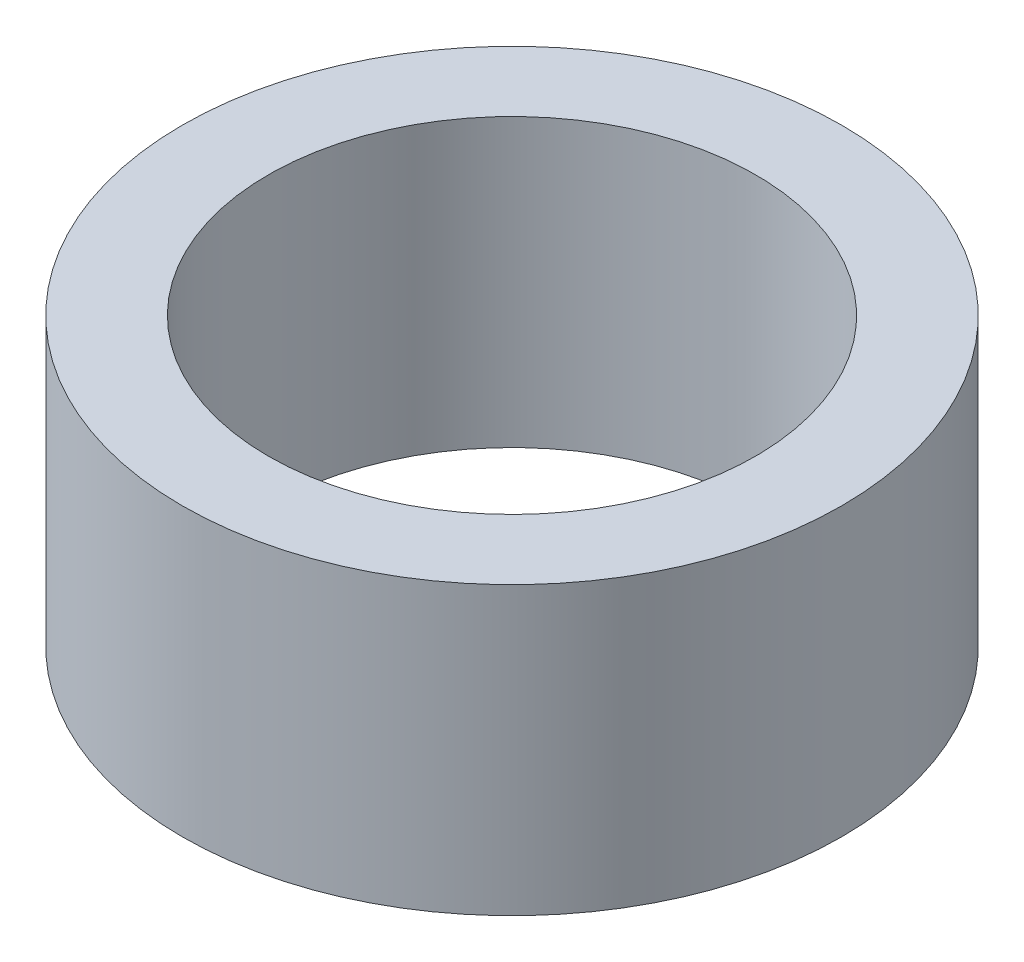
ISO-10303-21;
HEADER;
FILE_DESCRIPTION(('STEP AP214'),'2;1');
FILE_NAME('part.step','',(''),(''),'','','');
FILE_SCHEMA(('AUTOMOTIVE_DESIGN { 1 0 10303 214 1 1 1 1 }'));
ENDSEC;
DATA;
#1=APPLICATION_CONTEXT('core data for automotive mechanical design processes');
#2=APPLICATION_PROTOCOL_DEFINITION('international standard','automotive_design',2000,#1);
#3=PRODUCT_CONTEXT('',#1,'mechanical');
#4=PRODUCT('Part','Part','',(#3));
#5=PRODUCT_RELATED_PRODUCT_CATEGORY('part','',(#4));
#6=PRODUCT_DEFINITION_FORMATION('','',#4);
#7=PRODUCT_DEFINITION_CONTEXT('part definition',#1,'design');
#8=PRODUCT_DEFINITION('design','',#6,#7);
#9=PRODUCT_DEFINITION_SHAPE('','',#8);
#10=(LENGTH_UNIT() NAMED_UNIT(*) SI_UNIT(.MILLI.,.METRE.));
#11=(NAMED_UNIT(*) PLANE_ANGLE_UNIT() SI_UNIT($,.RADIAN.));
#12=(NAMED_UNIT(*) SI_UNIT($,.STERADIAN.) SOLID_ANGLE_UNIT());
#13=UNCERTAINTY_MEASURE_WITH_UNIT(LENGTH_MEASURE(1.E-05),#10,'distance_accuracy_value','');
#14=(GEOMETRIC_REPRESENTATION_CONTEXT(3) GLOBAL_UNCERTAINTY_ASSIGNED_CONTEXT((#13)) GLOBAL_UNIT_ASSIGNED_CONTEXT((#10,
#11,#12)) REPRESENTATION_CONTEXT('',''));
#15=CARTESIAN_POINT('',(0.,0.,0.));
#16=DIRECTION('',(0.,0.,1.));
#17=DIRECTION('',(1.,0.,0.));
#18=AXIS2_PLACEMENT_3D('',#15,#16,#17);
#19=CARTESIAN_POINT('',(0.,5.,0.));
#20=DIRECTION('',(0.,1.,0.));
#21=DIRECTION('',(0.,0.,1.));
#22=AXIS2_PLACEMENT_3D('',#19,#20,#21);
#23=PLANE('',#22);
#24=CARTESIAN_POINT('',(0.,5.,0.));
#25=DIRECTION('',(0.,1.,0.));
#26=DIRECTION('',(0.,0.,1.));
#27=AXIS2_PLACEMENT_3D('',#24,#25,#26);
#28=CIRCLE('',#27,5.75);
#29=CARTESIAN_POINT('',(0.,5.,5.75));
#30=VERTEX_POINT('',#29);
#31=EDGE_CURVE('E10',#30,#30,#28,.T.);
#32=ORIENTED_EDGE('',*,*,#31,.T.);
#33=EDGE_LOOP('',(#32));
#34=FACE_BOUND('',#33,.T.);
#35=CARTESIAN_POINT('',(0.,5.,0.));
#36=DIRECTION('',(0.,1.,0.));
#37=DIRECTION('',(0.,0.,1.));
#38=AXIS2_PLACEMENT_3D('',#35,#36,#37);
#39=CIRCLE('',#38,4.25);
#40=CARTESIAN_POINT('',(0.,5.,4.25));
#41=VERTEX_POINT('',#40);
#42=EDGE_CURVE('E45',#41,#41,#39,.T.);
#43=ORIENTED_EDGE('',*,*,#42,.F.);
#44=EDGE_LOOP('',(#43));
#45=FACE_BOUND('',#44,.T.);
#46=ADVANCED_FACE('F34',(#34,#45),#23,.T.);
#47=CARTESIAN_POINT('',(0.,0.,0.));
#48=DIRECTION('',(0.,1.,0.));
#49=DIRECTION('',(0.,0.,1.));
#50=AXIS2_PLACEMENT_3D('',#47,#48,#49);
#51=PLANE('',#50);
#52=CARTESIAN_POINT('',(0.,0.,0.));
#53=DIRECTION('',(0.,1.,0.));
#54=DIRECTION('',(0.,0.,1.));
#55=AXIS2_PLACEMENT_3D('',#52,#53,#54);
#56=CIRCLE('',#55,5.75);
#57=CARTESIAN_POINT('',(0.,0.,5.75));
#58=VERTEX_POINT('',#57);
#59=EDGE_CURVE('E38',#58,#58,#56,.T.);
#60=ORIENTED_EDGE('',*,*,#59,.F.);
#61=EDGE_LOOP('',(#60));
#62=FACE_BOUND('',#61,.T.);
#63=CARTESIAN_POINT('',(0.,0.,0.));
#64=DIRECTION('',(0.,1.,0.));
#65=DIRECTION('',(0.,0.,1.));
#66=AXIS2_PLACEMENT_3D('',#63,#64,#65);
#67=CIRCLE('',#66,4.25);
#68=CARTESIAN_POINT('',(0.,0.,4.25));
#69=VERTEX_POINT('',#68);
#70=EDGE_CURVE('E47',#69,#69,#67,.T.);
#71=ORIENTED_EDGE('',*,*,#70,.T.);
#72=EDGE_LOOP('',(#71));
#73=FACE_BOUND('',#72,.T.);
#74=ADVANCED_FACE('F57',(#62,#73),#51,.F.);
#75=CARTESIAN_POINT('',(0.,5.,0.));
#76=DIRECTION('',(0.,-1.,0.));
#77=DIRECTION('',(0.,0.,-1.));
#78=AXIS2_PLACEMENT_3D('',#75,#76,#77);
#79=CYLINDRICAL_SURFACE('',#78,5.75);
#80=ORIENTED_EDGE('',*,*,#31,.F.);
#81=EDGE_LOOP('',(#80));
#82=FACE_BOUND('',#81,.T.);
#83=ORIENTED_EDGE('',*,*,#59,.T.);
#84=EDGE_LOOP('',(#83));
#85=FACE_BOUND('',#84,.T.);
#86=ADVANCED_FACE('F36',(#82,#85),#79,.T.);
#87=CARTESIAN_POINT('',(0.,5.,0.));
#88=DIRECTION('',(0.,-1.,0.));
#89=DIRECTION('',(0.,0.,-1.));
#90=AXIS2_PLACEMENT_3D('',#87,#88,#89);
#91=CYLINDRICAL_SURFACE('',#90,4.25);
#92=ORIENTED_EDGE('',*,*,#42,.T.);
#93=EDGE_LOOP('',(#92));
#94=FACE_BOUND('',#93,.T.);
#95=ORIENTED_EDGE('',*,*,#70,.F.);
#96=EDGE_LOOP('',(#95));
#97=FACE_BOUND('',#96,.T.);
#98=ADVANCED_FACE('F53',(#94,#97),#91,.F.);
#99=CLOSED_SHELL('',(#46,#74,#86,#98));
#100=MANIFOLD_SOLID_BREP('B2',#99);
#101=ADVANCED_BREP_SHAPE_REPRESENTATION('',(#18,#100),#14);
#102=SHAPE_DEFINITION_REPRESENTATION(#9,#101);
ENDSEC;
END-ISO-10303-21;
